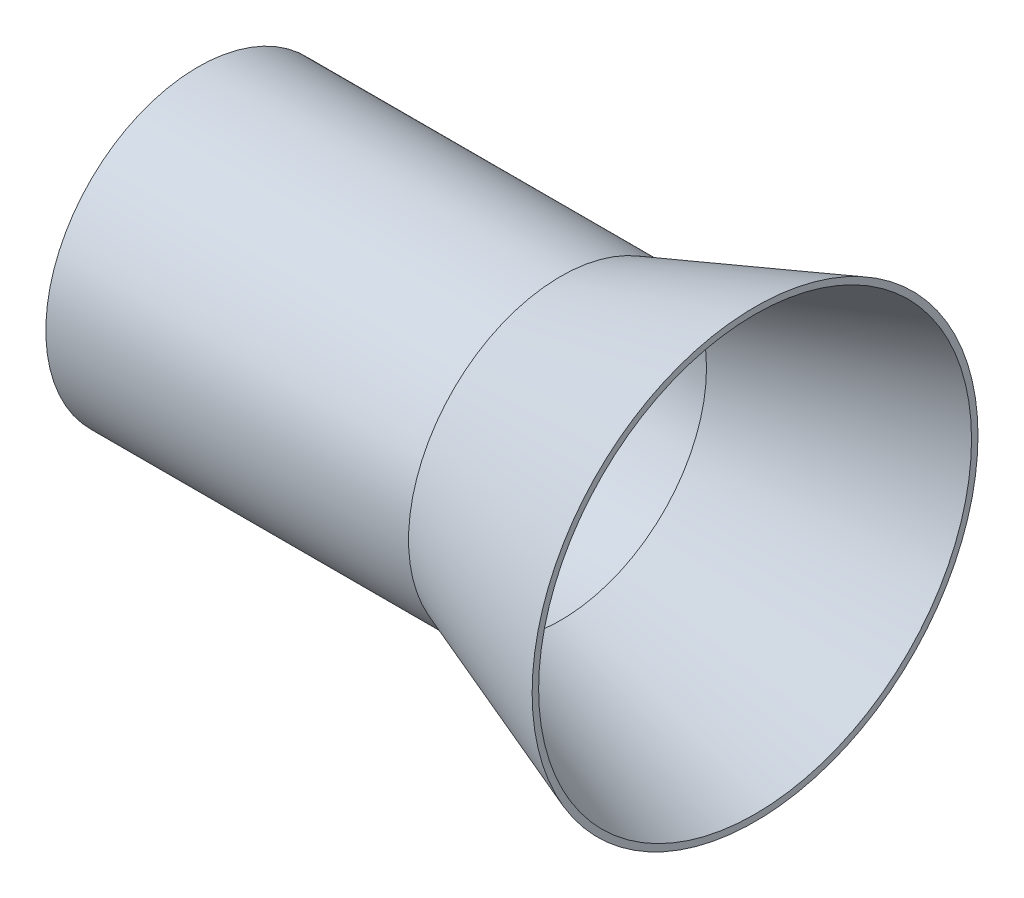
ISO-10303-21;
HEADER;
FILE_DESCRIPTION(('STEP AP214'),'2;1');
FILE_NAME('part.step','',(''),(''),'','','');
FILE_SCHEMA(('AUTOMOTIVE_DESIGN { 1 0 10303 214 1 1 1 1 }'));
ENDSEC;
DATA;
#1=APPLICATION_CONTEXT('core data for automotive mechanical design processes');
#2=APPLICATION_PROTOCOL_DEFINITION('international standard','automotive_design',2000,#1);
#3=PRODUCT_CONTEXT('',#1,'mechanical');
#4=PRODUCT('Part','Part','',(#3));
#5=PRODUCT_RELATED_PRODUCT_CATEGORY('part','',(#4));
#6=PRODUCT_DEFINITION_FORMATION('','',#4);
#7=PRODUCT_DEFINITION_CONTEXT('part definition',#1,'design');
#8=PRODUCT_DEFINITION('design','',#6,#7);
#9=PRODUCT_DEFINITION_SHAPE('','',#8);
#10=(LENGTH_UNIT() NAMED_UNIT(*) SI_UNIT(.MILLI.,.METRE.));
#11=(NAMED_UNIT(*) PLANE_ANGLE_UNIT() SI_UNIT($,.RADIAN.));
#12=(NAMED_UNIT(*) SI_UNIT($,.STERADIAN.) SOLID_ANGLE_UNIT());
#13=UNCERTAINTY_MEASURE_WITH_UNIT(LENGTH_MEASURE(1.E-05),#10,'distance_accuracy_value','');
#14=(GEOMETRIC_REPRESENTATION_CONTEXT(3) GLOBAL_UNCERTAINTY_ASSIGNED_CONTEXT((#13)) GLOBAL_UNIT_ASSIGNED_CONTEXT((#10,
#11,#12)) REPRESENTATION_CONTEXT('',''));
#15=CARTESIAN_POINT('',(0.,0.,0.));
#16=DIRECTION('',(0.,0.,1.));
#17=DIRECTION('',(1.,0.,0.));
#18=AXIS2_PLACEMENT_3D('',#15,#16,#17);
#19=CARTESIAN_POINT('',(0.,0.,0.));
#20=DIRECTION('',(1.,0.,0.));
#21=DIRECTION('',(0.,0.,-1.));
#22=AXIS2_PLACEMENT_3D('',#19,#20,#21);
#23=PLANE('',#22);
#24=CARTESIAN_POINT('',(0.,0.,0.));
#25=DIRECTION('',(1.,0.,0.));
#26=DIRECTION('',(0.,0.,-1.));
#27=AXIS2_PLACEMENT_3D('',#24,#25,#26);
#28=CIRCLE('',#27,47.);
#29=CARTESIAN_POINT('',(0.,0.,-47.));
#30=VERTEX_POINT('',#29);
#31=EDGE_CURVE('E37',#30,#30,#28,.T.);
#32=ORIENTED_EDGE('',*,*,#31,.F.);
#33=EDGE_LOOP('',(#32));
#34=FACE_BOUND('',#33,.T.);
#35=CARTESIAN_POINT('',(0.,0.,0.));
#36=DIRECTION('',(1.,0.,0.));
#37=DIRECTION('',(0.,0.,-1.));
#38=AXIS2_PLACEMENT_3D('',#35,#36,#37);
#39=CIRCLE('',#38,45.);
#40=CARTESIAN_POINT('',(0.,0.,-45.));
#41=VERTEX_POINT('',#40);
#42=EDGE_CURVE('E44',#41,#41,#39,.T.);
#43=ORIENTED_EDGE('',*,*,#42,.T.);
#44=EDGE_LOOP('',(#43));
#45=FACE_BOUND('',#44,.T.);
#46=ADVANCED_FACE('F33',(#34,#45),#23,.F.);
#47=CARTESIAN_POINT('',(112.,0.,0.));
#48=DIRECTION('',(-1.,0.,0.));
#49=DIRECTION('',(0.,0.,1.));
#50=AXIS2_PLACEMENT_3D('',#47,#48,#49);
#51=CYLINDRICAL_SURFACE('',#50,47.);
#52=CARTESIAN_POINT('',(112.,0.,0.));
#53=DIRECTION('',(1.,0.,0.));
#54=DIRECTION('',(0.,0.,-1.));
#55=AXIS2_PLACEMENT_3D('',#52,#53,#54);
#56=CIRCLE('',#55,47.);
#57=CARTESIAN_POINT('',(112.,0.,-47.));
#58=VERTEX_POINT('',#57);
#59=EDGE_CURVE('E10',#58,#58,#56,.T.);
#60=ORIENTED_EDGE('',*,*,#59,.F.);
#61=EDGE_LOOP('',(#60));
#62=FACE_BOUND('',#61,.T.);
#63=ORIENTED_EDGE('',*,*,#31,.T.);
#64=EDGE_LOOP('',(#63));
#65=FACE_BOUND('',#64,.T.);
#66=ADVANCED_FACE('F35',(#62,#65),#51,.T.);
#67=CARTESIAN_POINT('',(112.,0.,0.));
#68=DIRECTION('',(-1.,0.,0.));
#69=DIRECTION('',(0.,0.,1.));
#70=AXIS2_PLACEMENT_3D('',#67,#68,#69);
#71=CYLINDRICAL_SURFACE('',#70,45.);
#72=CARTESIAN_POINT('',(112.,0.,0.));
#73=DIRECTION('',(-1.,0.,0.));
#74=DIRECTION('',(0.,0.,1.));
#75=AXIS2_PLACEMENT_3D('',#72,#73,#74);
#76=CIRCLE('',#75,45.);
#77=CARTESIAN_POINT('',(112.,0.,45.));
#78=VERTEX_POINT('',#77);
#79=EDGE_CURVE('E48',#78,#78,#76,.T.);
#80=ORIENTED_EDGE('',*,*,#79,.F.);
#81=EDGE_LOOP('',(#80));
#82=FACE_BOUND('',#81,.T.);
#83=ORIENTED_EDGE('',*,*,#42,.F.);
#84=EDGE_LOOP('',(#83));
#85=FACE_BOUND('',#84,.T.);
#86=ADVANCED_FACE('F70',(#82,#85),#71,.F.);
#87=CARTESIAN_POINT('',(172.,0.,0.));
#88=DIRECTION('',(1.,0.,0.));
#89=DIRECTION('',(0.,0.,-1.));
#90=AXIS2_PLACEMENT_3D('',#87,#88,#89);
#91=CONICAL_SURFACE('',#90,66.8382140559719,0.349065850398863);
#92=ORIENTED_EDGE('',*,*,#79,.T.);
#93=EDGE_LOOP('',(#92));
#94=FACE_BOUND('',#93,.T.);
#95=CARTESIAN_POINT('',(172.,0.,0.));
#96=DIRECTION('',(-1.,0.,0.));
#97=DIRECTION('',(0.,0.,1.));
#98=AXIS2_PLACEMENT_3D('',#95,#96,#97);
#99=CIRCLE('',#98,66.8382140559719);
#100=CARTESIAN_POINT('',(172.,0.,66.8382140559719));
#101=VERTEX_POINT('',#100);
#102=EDGE_CURVE('E51',#101,#101,#99,.T.);
#103=ORIENTED_EDGE('',*,*,#102,.F.);
#104=EDGE_LOOP('',(#103));
#105=FACE_BOUND('',#104,.T.);
#106=ADVANCED_FACE('F62',(#94,#105),#91,.F.);
#107=CARTESIAN_POINT('',(172.,0.,66.8382140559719));
#108=DIRECTION('',(1.,0.,0.));
#109=DIRECTION('',(0.,0.,-1.));
#110=AXIS2_PLACEMENT_3D('',#107,#108,#109);
#111=PLANE('',#110);
#112=ORIENTED_EDGE('',*,*,#102,.T.);
#113=EDGE_LOOP('',(#112));
#114=FACE_BOUND('',#113,.T.);
#115=CARTESIAN_POINT('',(172.,0.,0.));
#116=DIRECTION('',(-1.,0.,0.));
#117=DIRECTION('',(0.,0.,1.));
#118=AXIS2_PLACEMENT_3D('',#115,#116,#117);
#119=CIRCLE('',#118,68.8382140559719);
#120=CARTESIAN_POINT('',(172.,0.,68.8382140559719));
#121=VERTEX_POINT('',#120);
#122=EDGE_CURVE('E54',#121,#121,#119,.T.);
#123=ORIENTED_EDGE('',*,*,#122,.F.);
#124=EDGE_LOOP('',(#123));
#125=FACE_BOUND('',#124,.T.);
#126=ADVANCED_FACE('F60',(#114,#125),#111,.T.);
#127=CARTESIAN_POINT('',(112.,0.,0.));
#128=DIRECTION('',(1.,0.,0.));
#129=DIRECTION('',(0.,0.,-1.));
#130=AXIS2_PLACEMENT_3D('',#127,#128,#129);
#131=CONICAL_SURFACE('',#130,47.,0.349065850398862);
#132=ORIENTED_EDGE('',*,*,#122,.T.);
#133=EDGE_LOOP('',(#132));
#134=FACE_BOUND('',#133,.T.);
#135=ORIENTED_EDGE('',*,*,#59,.T.);
#136=EDGE_LOOP('',(#135));
#137=FACE_BOUND('',#136,.T.);
#138=ADVANCED_FACE('F58',(#134,#137),#131,.T.);
#139=CLOSED_SHELL('',(#46,#66,#86,#106,#126,#138));
#140=MANIFOLD_SOLID_BREP('B2',#139);
#141=ADVANCED_BREP_SHAPE_REPRESENTATION('',(#18,#140),#14);
#142=SHAPE_DEFINITION_REPRESENTATION(#9,#141);
ENDSEC;
END-ISO-10303-21;
